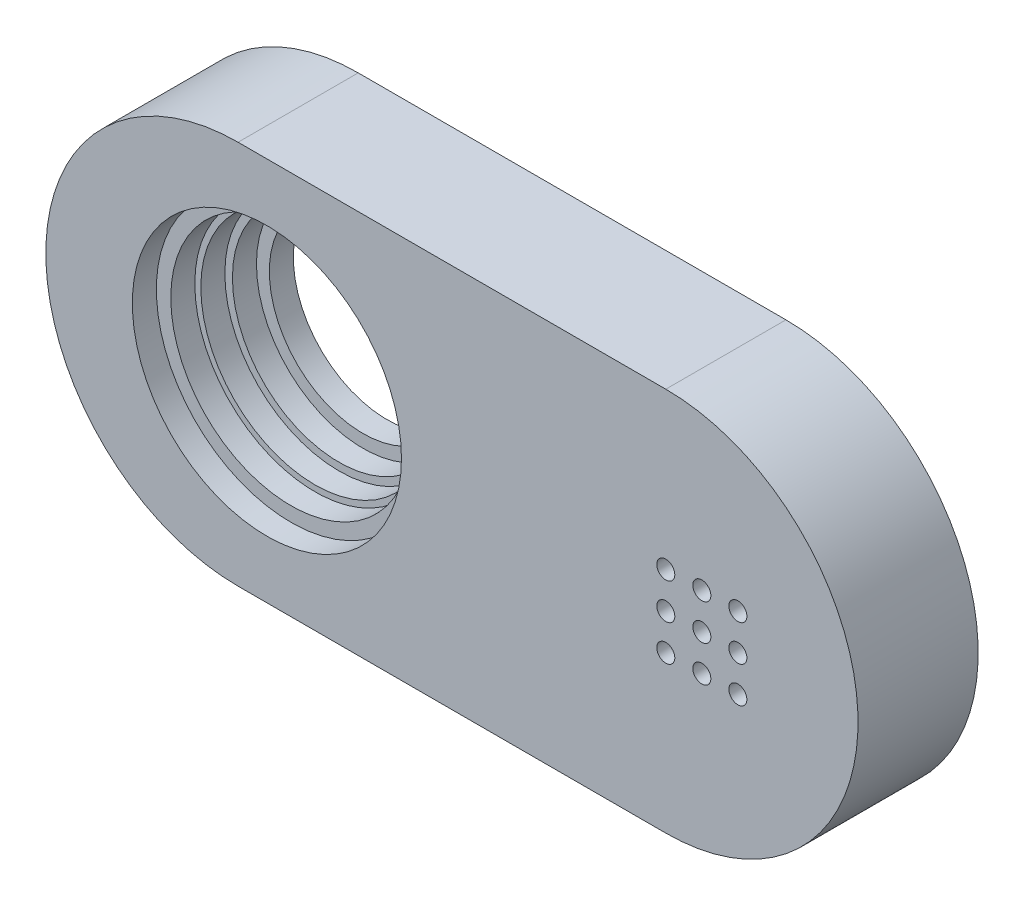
from build123d import *

# Parameters (mm, degrees)
BOSS_EXTRUDE1_DEPTH = 5
SKETCH2_R           = 3.9
CUT_EXTRUDE1_DEPTH  = 5
SKETCH3_R           = 4.435
CUT_EXTRUDE2_DEPTH  = 4
SKETCH4_R           = 4.75
CUT_EXTRUDE3_DEPTH  = 3
SKETCH5_R           = 5
CUT_EXTRUDE4_DEPTH  = 2
SKETCH6_R           = 5.6
CUT_EXTRUDE5_DEPTH  = 1
SKETCH7_R           = 0.375
CUT_EXTRUDE6_DEPTH  = 20.354844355


with BuildPart() as part:
    # Sketch1 → Boss-Extrude1 (new body)
    with BuildSketch(Plane.XY):
        with BuildLine():
            Line((-8.9, 8), (8.9, 8))
            ThreePointArc((8.9, 8), (16.9, 0), (8.9, -8))
            Line((8.9, -8), (-8.9, -8))
            ThreePointArc((-8.9, -8), (-16.9, 0), (-8.9, 8))
        make_face()
    extrude(amount=BOSS_EXTRUDE1_DEPTH)

    # Sketch2 → Cut-Extrude1 (cut)
    with BuildSketch(Plane.XY.offset(5)):
        with Locations((-7.7, 0)):
            Circle(SKETCH2_R)
    extrude(amount=-CUT_EXTRUDE1_DEPTH, mode=Mode.SUBTRACT)

    # Sketch3 → Cut-Extrude2 (cut)
    with BuildSketch(Plane.XY.offset(5)):
        with Locations((-7.7, 0)):
            Circle(SKETCH3_R)
    extrude(amount=-CUT_EXTRUDE2_DEPTH, mode=Mode.SUBTRACT)

    # Sketch4 → Cut-Extrude3 (cut)
    with BuildSketch(Plane.XY.offset(5)):
        with Locations((-7.7, 0)):
            Circle(SKETCH4_R)
    extrude(amount=-CUT_EXTRUDE3_DEPTH, mode=Mode.SUBTRACT)

    # Sketch5 → Cut-Extrude4 (cut)
    with BuildSketch(Plane.XY.offset(5)):
        with Locations((-7.7, 0)):
            Circle(SKETCH5_R)
    extrude(amount=-CUT_EXTRUDE4_DEPTH, mode=Mode.SUBTRACT)

    # Sketch6 → Cut-Extrude5 (cut)
    with BuildSketch(Plane.XY.offset(5)):
        with Locations((-7.7, 0)):
            Circle(SKETCH6_R)
    extrude(amount=-CUT_EXTRUDE5_DEPTH, mode=Mode.SUBTRACT)

    # Sketch7 → Cut-Extrude6 (cut, through all)
    with BuildSketch(Plane.XY.offset(5)):
        with Locations((10.4, 0)):
            Circle(SKETCH7_R)
        with Locations((8.9, 0)):
            Circle(SKETCH7_R)
        with Locations((11.9, 0)):
            Circle(SKETCH7_R)
        with Locations((8.9, -1.5)):
            Circle(SKETCH7_R)
        with Locations((10.4, -1.5)):
            Circle(SKETCH7_R)
        with Locations((11.9, -1.5)):
            Circle(SKETCH7_R)
        with Locations((8.9, 1.5)):
            Circle(SKETCH7_R)
        with Locations((10.4, 1.5)):
            Circle(SKETCH7_R)
        with Locations((11.9, 1.5)):
            Circle(SKETCH7_R)
    extrude(amount=-CUT_EXTRUDE6_DEPTH, mode=Mode.SUBTRACT)


solid = part.part
